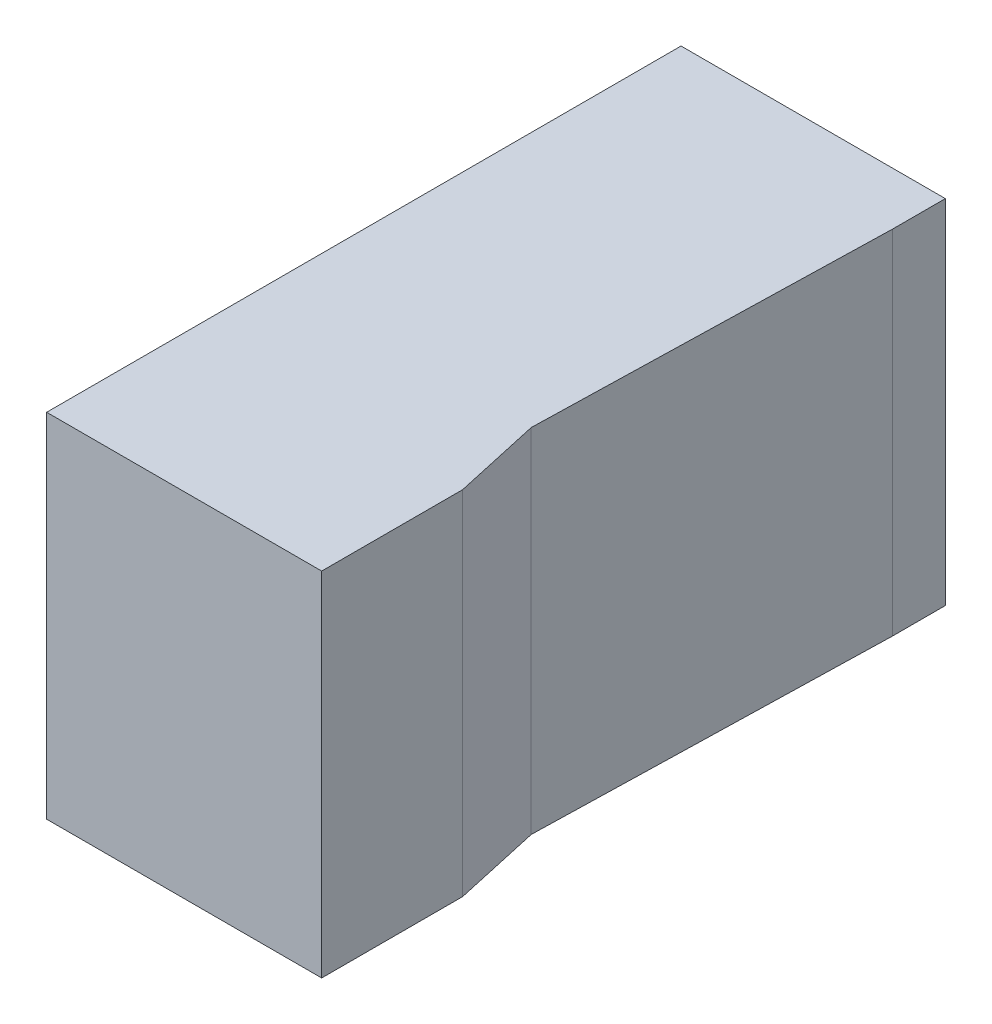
ISO-10303-21;
HEADER;
FILE_DESCRIPTION(('STEP AP214'),'2;1');
FILE_NAME('part.step','',(''),(''),'','','');
FILE_SCHEMA(('AUTOMOTIVE_DESIGN { 1 0 10303 214 1 1 1 1 }'));
ENDSEC;
DATA;
#1=APPLICATION_CONTEXT('core data for automotive mechanical design processes');
#2=APPLICATION_PROTOCOL_DEFINITION('international standard','automotive_design',2000,#1);
#3=PRODUCT_CONTEXT('',#1,'mechanical');
#4=PRODUCT('Part','Part','',(#3));
#5=PRODUCT_RELATED_PRODUCT_CATEGORY('part','',(#4));
#6=PRODUCT_DEFINITION_FORMATION('','',#4);
#7=PRODUCT_DEFINITION_CONTEXT('part definition',#1,'design');
#8=PRODUCT_DEFINITION('design','',#6,#7);
#9=PRODUCT_DEFINITION_SHAPE('','',#8);
#10=(LENGTH_UNIT() NAMED_UNIT(*) SI_UNIT(.MILLI.,.METRE.));
#11=(NAMED_UNIT(*) PLANE_ANGLE_UNIT() SI_UNIT($,.RADIAN.));
#12=(NAMED_UNIT(*) SI_UNIT($,.STERADIAN.) SOLID_ANGLE_UNIT());
#13=UNCERTAINTY_MEASURE_WITH_UNIT(LENGTH_MEASURE(1.E-05),#10,'distance_accuracy_value','');
#14=(GEOMETRIC_REPRESENTATION_CONTEXT(3) GLOBAL_UNCERTAINTY_ASSIGNED_CONTEXT((#13)) GLOBAL_UNIT_ASSIGNED_CONTEXT((#10,
#11,#12)) REPRESENTATION_CONTEXT('',''));
#15=CARTESIAN_POINT('',(0.,0.,0.));
#16=DIRECTION('',(0.,0.,1.));
#17=DIRECTION('',(1.,0.,0.));
#18=AXIS2_PLACEMENT_3D('',#15,#16,#17);
#19=CARTESIAN_POINT('',(-20.,10.,-20.));
#20=DIRECTION('',(-0.999687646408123,0.,-0.0249921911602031));
#21=DIRECTION('',(-0.0249921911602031,0.,0.999687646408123));
#22=AXIS2_PLACEMENT_3D('',#19,#20,#21);
#23=PLANE('',#22);
#24=DIRECTION('',(0.0249921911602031,0.,-0.999687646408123));
#25=VECTOR('',#24,1.);
#26=CARTESIAN_POINT('',(-20.,-10.,-20.));
#27=LINE('',#26,#25);
#28=CARTESIAN_POINT('',(-20.5,-10.,0.));
#29=VERTEX_POINT('',#28);
#30=CARTESIAN_POINT('',(-20.,-10.,-20.));
#31=VERTEX_POINT('',#30);
#32=EDGE_CURVE('E122',#29,#31,#27,.T.);
#33=ORIENTED_EDGE('',*,*,#32,.T.);
#34=DIRECTION('',(0.,-1.,0.));
#35=VECTOR('',#34,1.);
#36=CARTESIAN_POINT('',(-20.,10.,-20.));
#37=LINE('',#36,#35);
#38=CARTESIAN_POINT('',(-20.,10.,-20.));
#39=VERTEX_POINT('',#38);
#40=EDGE_CURVE('E11',#39,#31,#37,.T.);
#41=ORIENTED_EDGE('',*,*,#40,.F.);
#42=DIRECTION('',(0.0249921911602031,0.,-0.999687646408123));
#43=VECTOR('',#42,1.);
#44=CARTESIAN_POINT('',(-20.,10.,-20.));
#45=LINE('',#44,#43);
#46=CARTESIAN_POINT('',(-20.5,10.,0.));
#47=VERTEX_POINT('',#46);
#48=EDGE_CURVE('E134',#47,#39,#45,.T.);
#49=ORIENTED_EDGE('',*,*,#48,.F.);
#50=DIRECTION('',(0.,-1.,0.));
#51=VECTOR('',#50,1.);
#52=CARTESIAN_POINT('',(-20.5,10.,0.));
#53=LINE('',#52,#51);
#54=EDGE_CURVE('E118',#47,#29,#53,.T.);
#55=ORIENTED_EDGE('',*,*,#54,.T.);
#56=EDGE_LOOP('',(#33,#41,#49,#55));
#57=FACE_BOUND('',#56,.T.);
#58=ADVANCED_FACE('F32',(#57),#23,.F.);
#59=CARTESIAN_POINT('',(-20.,10.,-20.));
#60=DIRECTION('',(-1.,0.,0.));
#61=DIRECTION('',(0.,0.,1.));
#62=AXIS2_PLACEMENT_3D('',#59,#60,#61);
#63=PLANE('',#62);
#64=DIRECTION('',(0.,0.,-1.));
#65=VECTOR('',#64,1.);
#66=CARTESIAN_POINT('',(-20.,-10.,-20.));
#67=LINE('',#66,#65);
#68=CARTESIAN_POINT('',(-20.,-10.,-23.));
#69=VERTEX_POINT('',#68);
#70=EDGE_CURVE('E125',#31,#69,#67,.T.);
#71=ORIENTED_EDGE('',*,*,#70,.T.);
#72=DIRECTION('',(0.,-1.,0.));
#73=VECTOR('',#72,1.);
#74=CARTESIAN_POINT('',(-20.,10.,-23.));
#75=LINE('',#74,#73);
#76=CARTESIAN_POINT('',(-20.,10.,-23.));
#77=VERTEX_POINT('',#76);
#78=EDGE_CURVE('E40',#77,#69,#75,.T.);
#79=ORIENTED_EDGE('',*,*,#78,.F.);
#80=DIRECTION('',(0.,0.,-1.));
#81=VECTOR('',#80,1.);
#82=CARTESIAN_POINT('',(-20.,10.,-20.));
#83=LINE('',#82,#81);
#84=EDGE_CURVE('E88',#39,#77,#83,.T.);
#85=ORIENTED_EDGE('',*,*,#84,.F.);
#86=ORIENTED_EDGE('',*,*,#40,.T.);
#87=EDGE_LOOP('',(#71,#79,#85,#86));
#88=FACE_BOUND('',#87,.T.);
#89=ADVANCED_FACE('F159',(#88),#63,.F.);
#90=CARTESIAN_POINT('',(-20.,10.,-23.));
#91=DIRECTION('',(0.,0.,1.));
#92=DIRECTION('',(1.,0.,0.));
#93=AXIS2_PLACEMENT_3D('',#90,#91,#92);
#94=PLANE('',#93);
#95=DIRECTION('',(-1.,0.,0.));
#96=VECTOR('',#95,1.);
#97=CARTESIAN_POINT('',(-20.,-10.,-23.));
#98=LINE('',#97,#96);
#99=CARTESIAN_POINT('',(-35.,-10.,-23.));
#100=VERTEX_POINT('',#99);
#101=EDGE_CURVE('E127',#69,#100,#98,.T.);
#102=ORIENTED_EDGE('',*,*,#101,.T.);
#103=DIRECTION('',(0.,-1.,0.));
#104=VECTOR('',#103,1.);
#105=CARTESIAN_POINT('',(-35.,10.,-23.));
#106=LINE('',#105,#104);
#107=CARTESIAN_POINT('',(-35.,10.,-23.));
#108=VERTEX_POINT('',#107);
#109=EDGE_CURVE('E138',#108,#100,#106,.T.);
#110=ORIENTED_EDGE('',*,*,#109,.F.);
#111=DIRECTION('',(-1.,0.,0.));
#112=VECTOR('',#111,1.);
#113=CARTESIAN_POINT('',(-20.,10.,-23.));
#114=LINE('',#113,#112);
#115=EDGE_CURVE('E146',#77,#108,#114,.T.);
#116=ORIENTED_EDGE('',*,*,#115,.F.);
#117=ORIENTED_EDGE('',*,*,#78,.T.);
#118=EDGE_LOOP('',(#102,#110,#116,#117));
#119=FACE_BOUND('',#118,.T.);
#120=ADVANCED_FACE('F144',(#119),#94,.F.);
#121=CARTESIAN_POINT('',(-35.,10.,-23.));
#122=DIRECTION('',(1.,0.,0.));
#123=DIRECTION('',(0.,0.,-1.));
#124=AXIS2_PLACEMENT_3D('',#121,#122,#123);
#125=PLANE('',#124);
#126=DIRECTION('',(0.,0.,1.));
#127=VECTOR('',#126,1.);
#128=CARTESIAN_POINT('',(-35.,-10.,-23.));
#129=LINE('',#128,#127);
#130=CARTESIAN_POINT('',(-35.,-10.,13.));
#131=VERTEX_POINT('',#130);
#132=EDGE_CURVE('E129',#100,#131,#129,.T.);
#133=ORIENTED_EDGE('',*,*,#132,.T.);
#134=DIRECTION('',(0.,-1.,0.));
#135=VECTOR('',#134,1.);
#136=CARTESIAN_POINT('',(-35.,10.,13.));
#137=LINE('',#136,#135);
#138=CARTESIAN_POINT('',(-35.,10.,13.));
#139=VERTEX_POINT('',#138);
#140=EDGE_CURVE('E113',#139,#131,#137,.T.);
#141=ORIENTED_EDGE('',*,*,#140,.F.);
#142=DIRECTION('',(0.,0.,1.));
#143=VECTOR('',#142,1.);
#144=CARTESIAN_POINT('',(-35.,10.,-23.));
#145=LINE('',#144,#143);
#146=EDGE_CURVE('E104',#108,#139,#145,.T.);
#147=ORIENTED_EDGE('',*,*,#146,.F.);
#148=ORIENTED_EDGE('',*,*,#109,.T.);
#149=EDGE_LOOP('',(#133,#141,#147,#148));
#150=FACE_BOUND('',#149,.T.);
#151=ADVANCED_FACE('F152',(#150),#125,.F.);
#152=CARTESIAN_POINT('',(-19.3922728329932,10.,13.));
#153=DIRECTION('',(0.,0.,-1.));
#154=DIRECTION('',(-1.,0.,0.));
#155=AXIS2_PLACEMENT_3D('',#152,#153,#154);
#156=PLANE('',#155);
#157=DIRECTION('',(1.,0.,0.));
#158=VECTOR('',#157,1.);
#159=CARTESIAN_POINT('',(-19.3922728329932,-10.,13.));
#160=LINE('',#159,#158);
#161=CARTESIAN_POINT('',(-19.3922728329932,-10.,13.));
#162=VERTEX_POINT('',#161);
#163=EDGE_CURVE('E112',#131,#162,#160,.T.);
#164=ORIENTED_EDGE('',*,*,#163,.T.);
#165=DIRECTION('',(0.,-1.,0.));
#166=VECTOR('',#165,1.);
#167=CARTESIAN_POINT('',(-19.3922728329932,10.,13.));
#168=LINE('',#167,#166);
#169=CARTESIAN_POINT('',(-19.3922728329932,10.,13.));
#170=VERTEX_POINT('',#169);
#171=EDGE_CURVE('E109',#170,#162,#168,.T.);
#172=ORIENTED_EDGE('',*,*,#171,.F.);
#173=DIRECTION('',(1.,0.,0.));
#174=VECTOR('',#173,1.);
#175=CARTESIAN_POINT('',(-19.3922728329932,10.,13.));
#176=LINE('',#175,#174);
#177=EDGE_CURVE('E98',#139,#170,#176,.T.);
#178=ORIENTED_EDGE('',*,*,#177,.F.);
#179=ORIENTED_EDGE('',*,*,#140,.T.);
#180=EDGE_LOOP('',(#164,#172,#178,#179));
#181=FACE_BOUND('',#180,.T.);
#182=ADVANCED_FACE('F110',(#181),#156,.F.);
#183=CARTESIAN_POINT('',(-19.3922728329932,10.,5.));
#184=DIRECTION('',(-1.,0.,0.));
#185=DIRECTION('',(0.,0.,1.));
#186=AXIS2_PLACEMENT_3D('',#183,#184,#185);
#187=PLANE('',#186);
#188=DIRECTION('',(0.,0.,-1.));
#189=VECTOR('',#188,1.);
#190=CARTESIAN_POINT('',(-19.3922728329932,-10.,5.));
#191=LINE('',#190,#189);
#192=CARTESIAN_POINT('',(-19.3922728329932,-10.,5.));
#193=VERTEX_POINT('',#192);
#194=EDGE_CURVE('E74',#162,#193,#191,.T.);
#195=ORIENTED_EDGE('',*,*,#194,.T.);
#196=DIRECTION('',(0.,-1.,0.));
#197=VECTOR('',#196,1.);
#198=CARTESIAN_POINT('',(-19.3922728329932,10.,5.));
#199=LINE('',#198,#197);
#200=CARTESIAN_POINT('',(-19.3922728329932,10.,5.));
#201=VERTEX_POINT('',#200);
#202=EDGE_CURVE('E114',#201,#193,#199,.T.);
#203=ORIENTED_EDGE('',*,*,#202,.F.);
#204=DIRECTION('',(0.,0.,-1.));
#205=VECTOR('',#204,1.);
#206=CARTESIAN_POINT('',(-19.3922728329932,10.,5.));
#207=LINE('',#206,#205);
#208=EDGE_CURVE('E102',#170,#201,#207,.T.);
#209=ORIENTED_EDGE('',*,*,#208,.F.);
#210=ORIENTED_EDGE('',*,*,#171,.T.);
#211=EDGE_LOOP('',(#195,#203,#209,#210));
#212=FACE_BOUND('',#211,.T.);
#213=ADVANCED_FACE('F116',(#212),#187,.F.);
#214=CARTESIAN_POINT('',(-20.5,10.,0.));
#215=DIRECTION('',(-0.976326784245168,0.,0.216300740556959));
#216=DIRECTION('',(0.216300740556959,0.,0.976326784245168));
#217=AXIS2_PLACEMENT_3D('',#214,#215,#216);
#218=PLANE('',#217);
#219=DIRECTION('',(-0.216300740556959,0.,-0.976326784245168));
#220=VECTOR('',#219,1.);
#221=CARTESIAN_POINT('',(-20.5,-10.,0.));
#222=LINE('',#221,#220);
#223=EDGE_CURVE('E80',#193,#29,#222,.T.);
#224=ORIENTED_EDGE('',*,*,#223,.T.);
#225=ORIENTED_EDGE('',*,*,#54,.F.);
#226=DIRECTION('',(-0.216300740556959,0.,-0.976326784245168));
#227=VECTOR('',#226,1.);
#228=CARTESIAN_POINT('',(-20.5,10.,0.));
#229=LINE('',#228,#227);
#230=EDGE_CURVE('E48',#201,#47,#229,.T.);
#231=ORIENTED_EDGE('',*,*,#230,.F.);
#232=ORIENTED_EDGE('',*,*,#202,.T.);
#233=EDGE_LOOP('',(#224,#225,#231,#232));
#234=FACE_BOUND('',#233,.T.);
#235=ADVANCED_FACE('F173',(#234),#218,.F.);
#236=CARTESIAN_POINT('',(-20.825,10.,13.));
#237=DIRECTION('',(0.,-1.,0.));
#238=DIRECTION('',(0.,0.,-1.));
#239=AXIS2_PLACEMENT_3D('',#236,#237,#238);
#240=PLANE('',#239);
#241=ORIENTED_EDGE('',*,*,#48,.T.);
#242=ORIENTED_EDGE('',*,*,#84,.T.);
#243=ORIENTED_EDGE('',*,*,#115,.T.);
#244=ORIENTED_EDGE('',*,*,#146,.T.);
#245=ORIENTED_EDGE('',*,*,#177,.T.);
#246=ORIENTED_EDGE('',*,*,#208,.T.);
#247=ORIENTED_EDGE('',*,*,#230,.T.);
#248=EDGE_LOOP('',(#241,#242,#243,#244,#245,#246,#247));
#249=FACE_BOUND('',#248,.T.);
#250=ADVANCED_FACE('F100',(#249),#240,.F.);
#251=CARTESIAN_POINT('',(-20.825,-10.,13.));
#252=DIRECTION('',(0.,-1.,0.));
#253=DIRECTION('',(0.,0.,-1.));
#254=AXIS2_PLACEMENT_3D('',#251,#252,#253);
#255=PLANE('',#254);
#256=ORIENTED_EDGE('',*,*,#32,.F.);
#257=ORIENTED_EDGE('',*,*,#223,.F.);
#258=ORIENTED_EDGE('',*,*,#194,.F.);
#259=ORIENTED_EDGE('',*,*,#163,.F.);
#260=ORIENTED_EDGE('',*,*,#132,.F.);
#261=ORIENTED_EDGE('',*,*,#101,.F.);
#262=ORIENTED_EDGE('',*,*,#70,.F.);
#263=EDGE_LOOP('',(#256,#257,#258,#259,#260,#261,#262));
#264=FACE_BOUND('',#263,.T.);
#265=ADVANCED_FACE('F150',(#264),#255,.T.);
#266=CLOSED_SHELL('',(#58,#89,#120,#151,#182,#213,#235,#250,#265));
#267=MANIFOLD_SOLID_BREP('B2',#266);
#268=ADVANCED_BREP_SHAPE_REPRESENTATION('',(#18,#267),#14);
#269=SHAPE_DEFINITION_REPRESENTATION(#9,#268);
ENDSEC;
END-ISO-10303-21;
